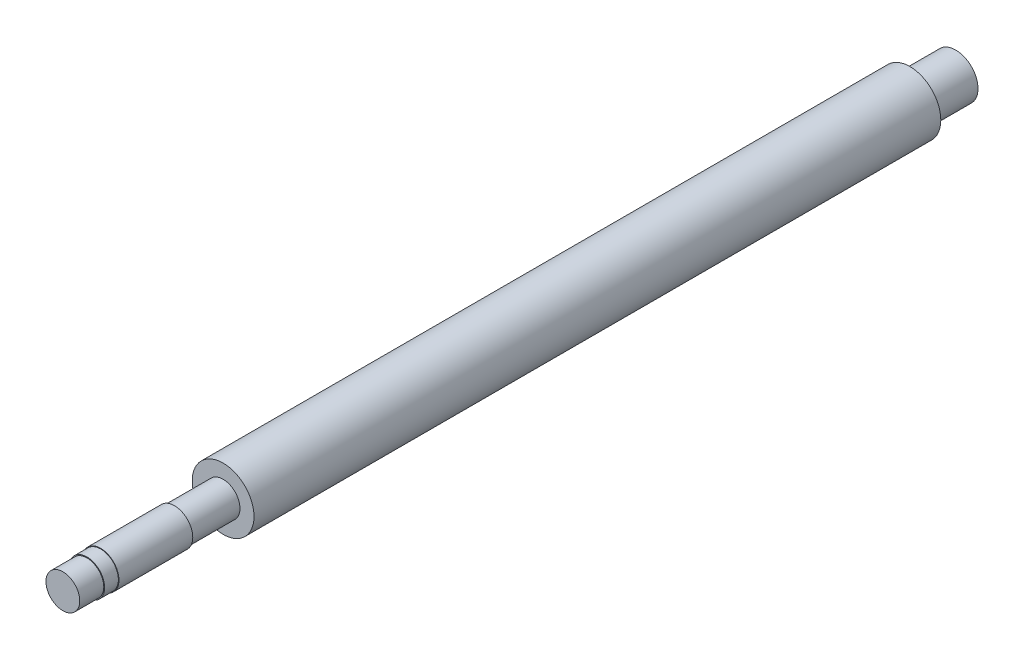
ISO-10303-21;
HEADER;
FILE_DESCRIPTION(('STEP AP214'),'2;1');
FILE_NAME('part.step','',(''),(''),'','','');
FILE_SCHEMA(('AUTOMOTIVE_DESIGN { 1 0 10303 214 1 1 1 1 }'));
ENDSEC;
DATA;
#1=APPLICATION_CONTEXT('core data for automotive mechanical design processes');
#2=APPLICATION_PROTOCOL_DEFINITION('international standard','automotive_design',2000,#1);
#3=PRODUCT_CONTEXT('',#1,'mechanical');
#4=PRODUCT('Part','Part','',(#3));
#5=PRODUCT_RELATED_PRODUCT_CATEGORY('part','',(#4));
#6=PRODUCT_DEFINITION_FORMATION('','',#4);
#7=PRODUCT_DEFINITION_CONTEXT('part definition',#1,'design');
#8=PRODUCT_DEFINITION('design','',#6,#7);
#9=PRODUCT_DEFINITION_SHAPE('','',#8);
#10=(LENGTH_UNIT() NAMED_UNIT(*) SI_UNIT(.MILLI.,.METRE.));
#11=(NAMED_UNIT(*) PLANE_ANGLE_UNIT() SI_UNIT($,.RADIAN.));
#12=(NAMED_UNIT(*) SI_UNIT($,.STERADIAN.) SOLID_ANGLE_UNIT());
#13=UNCERTAINTY_MEASURE_WITH_UNIT(LENGTH_MEASURE(1.E-05),#10,'distance_accuracy_value','');
#14=(GEOMETRIC_REPRESENTATION_CONTEXT(3) GLOBAL_UNCERTAINTY_ASSIGNED_CONTEXT((#13)) GLOBAL_UNIT_ASSIGNED_CONTEXT((#10,
#11,#12)) REPRESENTATION_CONTEXT('',''));
#15=CARTESIAN_POINT('',(0.,0.,0.));
#16=DIRECTION('',(0.,0.,1.));
#17=DIRECTION('',(1.,0.,0.));
#18=AXIS2_PLACEMENT_3D('',#15,#16,#17);
#19=CARTESIAN_POINT('',(0.,0.,74.));
#20=DIRECTION('',(0.,0.,-1.));
#21=DIRECTION('',(-1.,0.,0.));
#22=AXIS2_PLACEMENT_3D('',#19,#20,#21);
#23=CYLINDRICAL_SURFACE('',#22,1.475);
#24=CARTESIAN_POINT('',(0.,0.,60.));
#25=DIRECTION('',(0.,0.,1.));
#26=DIRECTION('',(1.,0.,0.));
#27=AXIS2_PLACEMENT_3D('',#24,#25,#26);
#28=CIRCLE('',#27,1.475);
#29=CARTESIAN_POINT('',(1.475,0.,60.));
#30=VERTEX_POINT('',#29);
#31=EDGE_CURVE('E55',#30,#30,#28,.T.);
#32=ORIENTED_EDGE('',*,*,#31,.T.);
#33=EDGE_LOOP('',(#32));
#34=FACE_BOUND('',#33,.T.);
#35=CARTESIAN_POINT('',(0.,0.,64.25));
#36=DIRECTION('',(0.,0.,1.));
#37=DIRECTION('',(1.,0.,0.));
#38=AXIS2_PLACEMENT_3D('',#35,#36,#37);
#39=CIRCLE('',#38,1.475);
#40=CARTESIAN_POINT('',(1.475,0.,64.25));
#41=VERTEX_POINT('',#40);
#42=EDGE_CURVE('E38',#41,#41,#39,.T.);
#43=ORIENTED_EDGE('',*,*,#42,.F.);
#44=EDGE_LOOP('',(#43));
#45=FACE_BOUND('',#44,.T.);
#46=ADVANCED_FACE('F31',(#34,#45),#23,.T.);
#47=CARTESIAN_POINT('',(0.,0.,0.));
#48=DIRECTION('',(0.,0.,1.));
#49=DIRECTION('',(1.,0.,0.));
#50=AXIS2_PLACEMENT_3D('',#47,#48,#49);
#51=PLANE('',#50);
#52=CARTESIAN_POINT('',(0.,0.,0.));
#53=DIRECTION('',(0.,0.,1.));
#54=DIRECTION('',(1.,0.,0.));
#55=AXIS2_PLACEMENT_3D('',#52,#53,#54);
#56=CIRCLE('',#55,2.7);
#57=CARTESIAN_POINT('',(2.7,0.,0.));
#58=VERTEX_POINT('',#57);
#59=EDGE_CURVE('E49',#58,#58,#56,.T.);
#60=ORIENTED_EDGE('',*,*,#59,.F.);
#61=EDGE_LOOP('',(#60));
#62=FACE_BOUND('',#61,.T.);
#63=CARTESIAN_POINT('',(0.,0.,0.));
#64=DIRECTION('',(0.,0.,1.));
#65=DIRECTION('',(1.,0.,0.));
#66=AXIS2_PLACEMENT_3D('',#63,#64,#65);
#67=CIRCLE('',#66,1.95);
#68=CARTESIAN_POINT('',(1.95,0.,0.));
#69=VERTEX_POINT('',#68);
#70=EDGE_CURVE('E42',#69,#69,#67,.F.);
#71=ORIENTED_EDGE('',*,*,#70,.F.);
#72=EDGE_LOOP('',(#71));
#73=FACE_BOUND('',#72,.T.);
#74=ADVANCED_FACE('F98',(#62,#73),#51,.F.);
#75=CARTESIAN_POINT('',(0.,0.,60.));
#76=DIRECTION('',(0.,0.,1.));
#77=DIRECTION('',(1.,0.,0.));
#78=AXIS2_PLACEMENT_3D('',#75,#76,#77);
#79=PLANE('',#78);
#80=CARTESIAN_POINT('',(0.,0.,60.));
#81=DIRECTION('',(0.,0.,1.));
#82=DIRECTION('',(1.,0.,0.));
#83=AXIS2_PLACEMENT_3D('',#80,#81,#82);
#84=CIRCLE('',#83,2.7);
#85=CARTESIAN_POINT('',(2.7,0.,60.));
#86=VERTEX_POINT('',#85);
#87=EDGE_CURVE('E46',#86,#86,#84,.T.);
#88=ORIENTED_EDGE('',*,*,#87,.T.);
#89=EDGE_LOOP('',(#88));
#90=FACE_BOUND('',#89,.T.);
#91=ORIENTED_EDGE('',*,*,#31,.F.);
#92=EDGE_LOOP('',(#91));
#93=FACE_BOUND('',#92,.T.);
#94=ADVANCED_FACE('F103',(#90,#93),#79,.T.);
#95=CARTESIAN_POINT('',(0.,0.,60.));
#96=DIRECTION('',(0.,0.,-1.));
#97=DIRECTION('',(-1.,0.,0.));
#98=AXIS2_PLACEMENT_3D('',#95,#96,#97);
#99=CYLINDRICAL_SURFACE('',#98,2.7);
#100=ORIENTED_EDGE('',*,*,#87,.F.);
#101=EDGE_LOOP('',(#100));
#102=FACE_BOUND('',#101,.T.);
#103=ORIENTED_EDGE('',*,*,#59,.T.);
#104=EDGE_LOOP('',(#103));
#105=FACE_BOUND('',#104,.T.);
#106=ADVANCED_FACE('F33',(#102,#105),#99,.T.);
#107=CARTESIAN_POINT('',(0.,0.,-4.));
#108=DIRECTION('',(0.,0.,1.));
#109=DIRECTION('',(1.,0.,0.));
#110=AXIS2_PLACEMENT_3D('',#107,#108,#109);
#111=CYLINDRICAL_SURFACE('',#110,1.95);
#112=CARTESIAN_POINT('',(0.,0.,-4.));
#113=DIRECTION('',(0.,0.,-1.));
#114=DIRECTION('',(-1.,0.,0.));
#115=AXIS2_PLACEMENT_3D('',#112,#113,#114);
#116=CIRCLE('',#115,1.95);
#117=CARTESIAN_POINT('',(-1.95,0.,-4.));
#118=VERTEX_POINT('',#117);
#119=EDGE_CURVE('E58',#118,#118,#116,.T.);
#120=ORIENTED_EDGE('',*,*,#119,.F.);
#121=EDGE_LOOP('',(#120));
#122=FACE_BOUND('',#121,.T.);
#123=ORIENTED_EDGE('',*,*,#70,.T.);
#124=EDGE_LOOP('',(#123));
#125=FACE_BOUND('',#124,.T.);
#126=ADVANCED_FACE('F112',(#122,#125),#111,.T.);
#127=CARTESIAN_POINT('',(0.,0.,-4.));
#128=DIRECTION('',(0.,0.,-1.));
#129=DIRECTION('',(-1.,0.,0.));
#130=AXIS2_PLACEMENT_3D('',#127,#128,#129);
#131=PLANE('',#130);
#132=ORIENTED_EDGE('',*,*,#119,.T.);
#133=EDGE_LOOP('',(#132));
#134=FACE_BOUND('',#133,.T.);
#135=ADVANCED_FACE('F123',(#134),#131,.T.);
#136=CARTESIAN_POINT('',(0.,0.,64.25));
#137=DIRECTION('',(0.,0.,1.));
#138=DIRECTION('',(1.,0.,0.));
#139=AXIS2_PLACEMENT_3D('',#136,#137,#138);
#140=CYLINDRICAL_SURFACE('',#139,1.6);
#141=CARTESIAN_POINT('',(0.,0.,64.25));
#142=DIRECTION('',(0.,0.,1.));
#143=DIRECTION('',(1.,0.,0.));
#144=AXIS2_PLACEMENT_3D('',#141,#142,#143);
#145=CIRCLE('',#144,1.6);
#146=CARTESIAN_POINT('',(1.6,0.,64.25));
#147=VERTEX_POINT('',#146);
#148=EDGE_CURVE('E63',#147,#147,#145,.T.);
#149=CARTESIAN_POINT('',(0.,0.,70.7));
#150=DIRECTION('',(0.,0.,1.));
#151=DIRECTION('',(1.,0.,0.));
#152=AXIS2_PLACEMENT_3D('',#149,#150,#151);
#153=CIRCLE('',#152,1.6);
#154=CARTESIAN_POINT('',(1.6,0.,70.7));
#155=VERTEX_POINT('',#154);
#156=EDGE_CURVE('E64',#155,#155,#153,.T.);
#157=CARTESIAN_POINT('',(1.6,0.,64.25));
#158=CARTESIAN_POINT('',(1.6,0.,64.3171875));
#159=CARTESIAN_POINT('',(1.6,0.,64.384375));
#160=CARTESIAN_POINT('',(1.6,0.,64.51875));
#161=CARTESIAN_POINT('',(1.6,0.,64.5859375));
#162=CARTESIAN_POINT('',(1.6,0.,64.7203125));
#163=CARTESIAN_POINT('',(1.6,0.,64.7875));
#164=CARTESIAN_POINT('',(1.6,0.,64.921875));
#165=CARTESIAN_POINT('',(1.6,0.,64.9890625));
#166=CARTESIAN_POINT('',(1.6,0.,65.1234375));
#167=CARTESIAN_POINT('',(1.6,0.,65.190625));
#168=CARTESIAN_POINT('',(1.6,0.,65.325));
#169=CARTESIAN_POINT('',(1.6,0.,65.3921875));
#170=CARTESIAN_POINT('',(1.6,0.,65.5265625));
#171=CARTESIAN_POINT('',(1.6,0.,65.59375));
#172=CARTESIAN_POINT('',(1.6,0.,65.728125));
#173=CARTESIAN_POINT('',(1.6,0.,65.7953125));
#174=CARTESIAN_POINT('',(1.6,0.,65.9296875));
#175=CARTESIAN_POINT('',(1.6,0.,65.996875));
#176=CARTESIAN_POINT('',(1.6,0.,66.13125));
#177=CARTESIAN_POINT('',(1.6,0.,66.1984375));
#178=CARTESIAN_POINT('',(1.6,0.,66.3328125));
#179=CARTESIAN_POINT('',(1.6,0.,66.4));
#180=CARTESIAN_POINT('',(1.6,0.,66.534375));
#181=CARTESIAN_POINT('',(1.6,0.,66.6015625));
#182=CARTESIAN_POINT('',(1.6,0.,66.7359375));
#183=CARTESIAN_POINT('',(1.6,0.,66.803125));
#184=CARTESIAN_POINT('',(1.6,0.,66.9375));
#185=CARTESIAN_POINT('',(1.6,0.,67.0046875));
#186=CARTESIAN_POINT('',(1.6,0.,67.1390625));
#187=CARTESIAN_POINT('',(1.6,0.,67.20625));
#188=CARTESIAN_POINT('',(1.6,0.,67.340625));
#189=CARTESIAN_POINT('',(1.6,0.,67.4078125));
#190=CARTESIAN_POINT('',(1.6,0.,67.5421875));
#191=CARTESIAN_POINT('',(1.6,0.,67.609375));
#192=CARTESIAN_POINT('',(1.6,0.,67.74375));
#193=CARTESIAN_POINT('',(1.6,0.,67.8109375));
#194=CARTESIAN_POINT('',(1.6,0.,67.9453125));
#195=CARTESIAN_POINT('',(1.6,0.,68.0125));
#196=CARTESIAN_POINT('',(1.6,0.,68.146875));
#197=CARTESIAN_POINT('',(1.6,0.,68.2140625));
#198=CARTESIAN_POINT('',(1.6,0.,68.3484375));
#199=CARTESIAN_POINT('',(1.6,0.,68.415625));
#200=CARTESIAN_POINT('',(1.6,0.,68.55));
#201=CARTESIAN_POINT('',(1.6,0.,68.6171875));
#202=CARTESIAN_POINT('',(1.6,0.,68.7515625));
#203=CARTESIAN_POINT('',(1.6,0.,68.81875));
#204=CARTESIAN_POINT('',(1.6,0.,68.953125));
#205=CARTESIAN_POINT('',(1.6,0.,69.0203125));
#206=CARTESIAN_POINT('',(1.6,0.,69.1546875));
#207=CARTESIAN_POINT('',(1.6,0.,69.221875));
#208=CARTESIAN_POINT('',(1.6,0.,69.35625));
#209=CARTESIAN_POINT('',(1.6,0.,69.4234375));
#210=CARTESIAN_POINT('',(1.6,0.,69.5578125));
#211=CARTESIAN_POINT('',(1.6,0.,69.625));
#212=CARTESIAN_POINT('',(1.6,0.,69.759375));
#213=CARTESIAN_POINT('',(1.6,0.,69.8265625));
#214=CARTESIAN_POINT('',(1.6,0.,69.9609375));
#215=CARTESIAN_POINT('',(1.6,0.,70.028125));
#216=CARTESIAN_POINT('',(1.6,0.,70.1625));
#217=CARTESIAN_POINT('',(1.6,0.,70.2296875));
#218=CARTESIAN_POINT('',(1.6,0.,70.3640625));
#219=CARTESIAN_POINT('',(1.6,0.,70.43125));
#220=CARTESIAN_POINT('',(1.6,0.,70.565625));
#221=CARTESIAN_POINT('',(1.6,0.,70.6328125));
#222=CARTESIAN_POINT('',(1.6,0.,70.7));
#223=B_SPLINE_CURVE_WITH_KNOTS('',3,(#157,#158,#159,#160,#161,#162,#163,#164,#165,#166,#167,
#168,#169,#170,#171,#172,#173,#174,#175,#176,#177,#178,#179,#180,#181,#182,#183,#184,#185,#186,
#187,#188,#189,#190,#191,#192,#193,#194,#195,#196,#197,#198,#199,#200,#201,#202,#203,#204,#205,
#206,#207,#208,#209,#210,#211,#212,#213,#214,#215,#216,#217,#218,#219,#220,#221,#222),
.UNSPECIFIED.,.F.,.F.,(4,2,2,2,2,2,2,2,2,2,2,2,2,2,2,2,2,2,2,2,2,2,2,2,2,2,2,2,2,2,2,2,4),(0.,
0.201562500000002,0.403125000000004,0.604687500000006,0.806250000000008,1.00781250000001,
1.20937500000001,1.4109375,1.6125,1.8140625,2.01562500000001,2.21718750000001,2.41875000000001,
2.62031250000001,2.821875,3.0234375,3.22500000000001,3.42656250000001,3.62812500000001,
3.82968750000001,4.03125,4.2328125,4.434375,4.63593750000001,4.83750000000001,5.03906250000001,
5.24062500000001,5.4421875,5.64375,5.8453125,6.04687500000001,6.24843750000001,
6.45000000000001),.UNSPECIFIED.);
#224=EDGE_CURVE('BSEAM128',#147,#155,#223,.T.);
#225=ORIENTED_EDGE('',*,*,#148,.T.);
#226=ORIENTED_EDGE('',*,*,#156,.F.);
#227=ORIENTED_EDGE('',*,*,#224,.T.);
#228=ORIENTED_EDGE('',*,*,#224,.F.);
#229=EDGE_LOOP('',(#225,#227,#226,#228));
#230=FACE_BOUND('',#229,.T.);
#231=ADVANCED_FACE('F128',(#230),#140,.T.);
#232=CARTESIAN_POINT('',(0.,0.,64.25));
#233=DIRECTION('',(0.,0.,1.));
#234=DIRECTION('',(1.,0.,0.));
#235=AXIS2_PLACEMENT_3D('',#232,#233,#234);
#236=PLANE('',#235);
#237=ORIENTED_EDGE('',*,*,#42,.T.);
#238=EDGE_LOOP('',(#237));
#239=FACE_BOUND('',#238,.T.);
#240=ORIENTED_EDGE('',*,*,#148,.F.);
#241=EDGE_LOOP('',(#240));
#242=FACE_BOUND('',#241,.T.);
#243=ADVANCED_FACE('F135',(#239,#242),#236,.F.);
#244=CARTESIAN_POINT('',(0.,0.,70.7));
#245=DIRECTION('',(0.,0.,1.));
#246=DIRECTION('',(1.,0.,0.));
#247=AXIS2_PLACEMENT_3D('',#244,#245,#246);
#248=PLANE('',#247);
#249=CARTESIAN_POINT('',(0.,0.,70.699999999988));
#250=DIRECTION('',(0.,0.,1.));
#251=DIRECTION('',(1.,0.,0.));
#252=AXIS2_PLACEMENT_3D('',#249,#250,#251);
#253=CIRCLE('',#252,1.55);
#254=CARTESIAN_POINT('',(1.55,0.,70.699999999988));
#255=VERTEX_POINT('',#254);
#256=EDGE_CURVE('E10',#255,#255,#253,.T.);
#257=ORIENTED_EDGE('',*,*,#256,.F.);
#258=EDGE_LOOP('',(#257));
#259=FACE_BOUND('',#258,.T.);
#260=ORIENTED_EDGE('',*,*,#156,.T.);
#261=EDGE_LOOP('',(#260));
#262=FACE_BOUND('',#261,.T.);
#263=ADVANCED_FACE('F93',(#259,#262),#248,.T.);
#264=CARTESIAN_POINT('',(0.,0.,-500000.));
#265=DIRECTION('',(0.,0.,1.));
#266=DIRECTION('',(1.,0.,0.));
#267=AXIS2_PLACEMENT_3D('',#264,#265,#266);
#268=CYLINDRICAL_SURFACE('',#267,1.55);
#269=ORIENTED_EDGE('',*,*,#256,.T.);
#270=EDGE_LOOP('',(#269));
#271=FACE_BOUND('',#270,.T.);
#272=CARTESIAN_POINT('',(0.,0.,71.9));
#273=DIRECTION('',(0.,0.,1.));
#274=DIRECTION('',(1.,0.,0.));
#275=AXIS2_PLACEMENT_3D('',#272,#273,#274);
#276=CIRCLE('',#275,1.55);
#277=CARTESIAN_POINT('',(1.55,0.,71.9));
#278=VERTEX_POINT('',#277);
#279=EDGE_CURVE('E67',#278,#278,#276,.T.);
#280=ORIENTED_EDGE('',*,*,#279,.F.);
#281=EDGE_LOOP('',(#280));
#282=FACE_BOUND('',#281,.T.);
#283=ADVANCED_FACE('F88',(#271,#282),#268,.T.);
#284=CARTESIAN_POINT('',(0.,0.,71.9));
#285=DIRECTION('',(0.,0.,1.));
#286=DIRECTION('',(1.,0.,0.));
#287=AXIS2_PLACEMENT_3D('',#284,#285,#286);
#288=PLANE('',#287);
#289=CARTESIAN_POINT('',(0.,0.,71.9));
#290=DIRECTION('',(0.,0.,1.));
#291=DIRECTION('',(1.,0.,0.));
#292=AXIS2_PLACEMENT_3D('',#289,#290,#291);
#293=CIRCLE('',#292,1.475);
#294=CARTESIAN_POINT('',(1.475,0.,71.9));
#295=VERTEX_POINT('',#294);
#296=EDGE_CURVE('E72',#295,#295,#293,.F.);
#297=ORIENTED_EDGE('',*,*,#296,.T.);
#298=EDGE_LOOP('',(#297));
#299=FACE_BOUND('',#298,.T.);
#300=ORIENTED_EDGE('',*,*,#279,.T.);
#301=EDGE_LOOP('',(#300));
#302=FACE_BOUND('',#301,.T.);
#303=ADVANCED_FACE('F76',(#299,#302),#288,.T.);
#304=CARTESIAN_POINT('',(0.,0.,74.));
#305=DIRECTION('',(0.,0.,1.));
#306=DIRECTION('',(1.,0.,0.));
#307=AXIS2_PLACEMENT_3D('',#304,#305,#306);
#308=PLANE('',#307);
#309=CARTESIAN_POINT('',(0.,0.,74.));
#310=DIRECTION('',(0.,0.,1.));
#311=DIRECTION('',(1.,0.,0.));
#312=AXIS2_PLACEMENT_3D('',#309,#310,#311);
#313=CIRCLE('',#312,1.475);
#314=CARTESIAN_POINT('',(1.475,0.,74.));
#315=VERTEX_POINT('',#314);
#316=EDGE_CURVE('E52',#315,#315,#313,.T.);
#317=ORIENTED_EDGE('',*,*,#316,.T.);
#318=EDGE_LOOP('',(#317));
#319=FACE_BOUND('',#318,.T.);
#320=ADVANCED_FACE('F82',(#319),#308,.T.);
#321=ORIENTED_EDGE('',*,*,#296,.F.);
#322=EDGE_LOOP('',(#321));
#323=FACE_BOUND('',#322,.T.);
#324=ORIENTED_EDGE('',*,*,#316,.F.);
#325=EDGE_LOOP('',(#324));
#326=FACE_BOUND('',#325,.T.);
#327=ADVANCED_FACE('F79',(#323,#326),#23,.T.);
#328=CLOSED_SHELL('',(#46,#74,#94,#106,#126,#135,#231,#243,#263,#283,#303,#320,#327));
#329=MANIFOLD_SOLID_BREP('B2',#328);
#330=ADVANCED_BREP_SHAPE_REPRESENTATION('',(#18,#329),#14);
#331=SHAPE_DEFINITION_REPRESENTATION(#9,#330);
ENDSEC;
END-ISO-10303-21;
